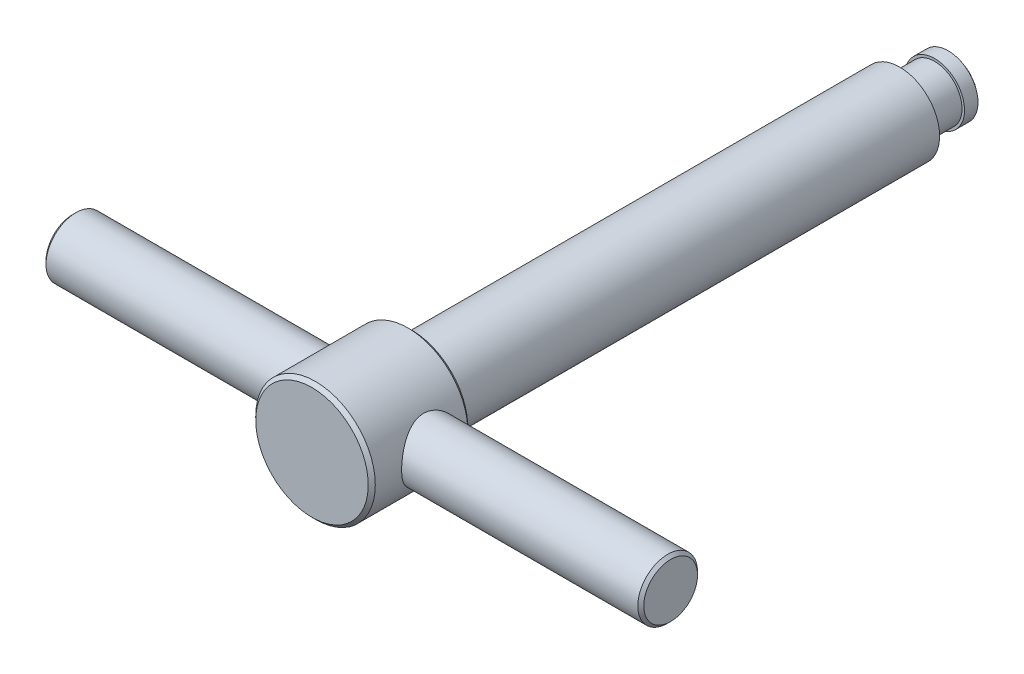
ISO-10303-21;
HEADER;
FILE_DESCRIPTION(('STEP AP214'),'2;1');
FILE_NAME('part.step','',(''),(''),'','','');
FILE_SCHEMA(('AUTOMOTIVE_DESIGN { 1 0 10303 214 1 1 1 1 }'));
ENDSEC;
DATA;
#1=APPLICATION_CONTEXT('core data for automotive mechanical design processes');
#2=APPLICATION_PROTOCOL_DEFINITION('international standard','automotive_design',2000,#1);
#3=PRODUCT_CONTEXT('',#1,'mechanical');
#4=PRODUCT('Part','Part','',(#3));
#5=PRODUCT_RELATED_PRODUCT_CATEGORY('part','',(#4));
#6=PRODUCT_DEFINITION_FORMATION('','',#4);
#7=PRODUCT_DEFINITION_CONTEXT('part definition',#1,'design');
#8=PRODUCT_DEFINITION('design','',#6,#7);
#9=PRODUCT_DEFINITION_SHAPE('','',#8);
#10=(LENGTH_UNIT() NAMED_UNIT(*) SI_UNIT(.MILLI.,.METRE.));
#11=(NAMED_UNIT(*) PLANE_ANGLE_UNIT() SI_UNIT($,.RADIAN.));
#12=(NAMED_UNIT(*) SI_UNIT($,.STERADIAN.) SOLID_ANGLE_UNIT());
#13=UNCERTAINTY_MEASURE_WITH_UNIT(LENGTH_MEASURE(1.E-05),#10,'distance_accuracy_value','');
#14=(GEOMETRIC_REPRESENTATION_CONTEXT(3) GLOBAL_UNCERTAINTY_ASSIGNED_CONTEXT((#13)) GLOBAL_UNIT_ASSIGNED_CONTEXT((#10,
#11,#12)) REPRESENTATION_CONTEXT('',''));
#15=CARTESIAN_POINT('',(0.,0.,0.));
#16=DIRECTION('',(0.,0.,1.));
#17=DIRECTION('',(1.,0.,0.));
#18=AXIS2_PLACEMENT_3D('',#15,#16,#17);
#19=CARTESIAN_POINT('',(60.,0.,123.4));
#20=DIRECTION('',(-1.,0.,0.));
#21=DIRECTION('',(0.,-1.,0.));
#22=AXIS2_PLACEMENT_3D('',#19,#20,#21);
#23=PLANE('',#22);
#24=CARTESIAN_POINT('',(60.0000000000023,0.,118.));
#25=DIRECTION('',(-1.,0.,0.));
#26=DIRECTION('',(0.,-1.,0.));
#27=AXIS2_PLACEMENT_3D('',#24,#25,#26);
#28=CIRCLE('',#27,5.39999999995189);
#29=CARTESIAN_POINT('',(60.0000000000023,-5.39999999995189,118.));
#30=VERTEX_POINT('',#29);
#31=EDGE_CURVE('E15',#30,#30,#28,.T.);
#32=ORIENTED_EDGE('',*,*,#31,.F.);
#33=EDGE_LOOP('',(#32));
#34=FACE_BOUND('',#33,.T.);
#35=ADVANCED_FACE('F12',(#34),#23,.F.);
#36=CARTESIAN_POINT('',(-60.,0.,118.));
#37=DIRECTION('',(1.,0.,0.));
#38=DIRECTION('',(0.,1.,0.));
#39=AXIS2_PLACEMENT_3D('',#36,#37,#38);
#40=PLANE('',#39);
#41=CARTESIAN_POINT('',(-60.0000000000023,0.,118.));
#42=DIRECTION('',(1.,0.,0.));
#43=DIRECTION('',(0.,0.,1.));
#44=AXIS2_PLACEMENT_3D('',#41,#42,#43);
#45=CIRCLE('',#44,5.40000000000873);
#46=CARTESIAN_POINT('',(-60.0000000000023,0.,123.400000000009));
#47=VERTEX_POINT('',#46);
#48=EDGE_CURVE('E133',#47,#47,#45,.T.);
#49=ORIENTED_EDGE('',*,*,#48,.F.);
#50=EDGE_LOOP('',(#49));
#51=FACE_BOUND('',#50,.T.);
#52=ADVANCED_FACE('F171',(#51),#40,.F.);
#53=CARTESIAN_POINT('',(0.,0.,9.));
#54=DIRECTION('',(-1.,0.,0.));
#55=DIRECTION('',(0.,1.,0.));
#56=AXIS2_PLACEMENT_3D('',#53,#54,#55);
#57=SPHERICAL_SURFACE('',#56,9.);
#58=CARTESIAN_POINT('',(0.,0.,2.29179606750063));
#59=DIRECTION('',(0.,0.,1.));
#60=DIRECTION('',(0.,-1.,0.));
#61=AXIS2_PLACEMENT_3D('',#58,#59,#60);
#62=CIRCLE('',#61,6.);
#63=CARTESIAN_POINT('',(0.,-6.,2.29179606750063));
#64=VERTEX_POINT('',#63);
#65=EDGE_CURVE('E126',#64,#64,#62,.T.);
#66=ORIENTED_EDGE('',*,*,#65,.F.);
#67=EDGE_LOOP('',(#66));
#68=FACE_BOUND('',#67,.T.);
#69=ADVANCED_FACE('F168',(#68),#57,.T.);
#70=CARTESIAN_POINT('',(59.400000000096,0.,118.));
#71=DIRECTION('',(-1.,0.,0.));
#72=DIRECTION('',(0.,-1.,0.));
#73=AXIS2_PLACEMENT_3D('',#70,#71,#72);
#74=CONICAL_SURFACE('',#73,5.99999999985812,0.785398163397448);
#75=CARTESIAN_POINT('',(59.4,0.,118.));
#76=DIRECTION('',(-1.,0.,0.));
#77=DIRECTION('',(0.,-1.,0.));
#78=AXIS2_PLACEMENT_3D('',#75,#76,#77);
#79=CIRCLE('',#78,6.);
#80=CARTESIAN_POINT('',(59.4,-6.,118.));
#81=VERTEX_POINT('',#80);
#82=EDGE_CURVE('E124',#81,#81,#79,.T.);
#83=ORIENTED_EDGE('',*,*,#82,.F.);
#84=EDGE_LOOP('',(#83));
#85=FACE_BOUND('',#84,.T.);
#86=ORIENTED_EDGE('',*,*,#31,.T.);
#87=EDGE_LOOP('',(#86));
#88=FACE_BOUND('',#87,.T.);
#89=ADVANCED_FACE('F164',(#85,#88),#74,.T.);
#90=CARTESIAN_POINT('',(0.,0.,130.));
#91=DIRECTION('',(0.,0.,-1.));
#92=DIRECTION('',(0.,1.,0.));
#93=AXIS2_PLACEMENT_3D('',#90,#91,#92);
#94=PLANE('',#93);
#95=CARTESIAN_POINT('',(0.,0.,130.));
#96=DIRECTION('',(0.,0.,-1.));
#97=DIRECTION('',(0.,1.,0.));
#98=AXIS2_PLACEMENT_3D('',#95,#96,#97);
#99=CIRCLE('',#98,11.2928932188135);
#100=CARTESIAN_POINT('',(0.,11.2928932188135,130.));
#101=VERTEX_POINT('',#100);
#102=EDGE_CURVE('E121',#101,#101,#99,.T.);
#103=ORIENTED_EDGE('',*,*,#102,.F.);
#104=EDGE_LOOP('',(#103));
#105=FACE_BOUND('',#104,.T.);
#106=ADVANCED_FACE('F160',(#105),#94,.F.);
#107=CARTESIAN_POINT('',(-59.3999999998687,0.,118.));
#108=DIRECTION('',(1.,0.,0.));
#109=DIRECTION('',(0.,0.,1.));
#110=AXIS2_PLACEMENT_3D('',#107,#108,#109);
#111=CONICAL_SURFACE('',#110,6.00000000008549,0.785398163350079);
#112=ORIENTED_EDGE('',*,*,#48,.T.);
#113=EDGE_LOOP('',(#112));
#114=FACE_BOUND('',#113,.T.);
#115=CARTESIAN_POINT('',(-59.4,0.,118.));
#116=DIRECTION('',(-1.,0.,0.));
#117=DIRECTION('',(0.,-1.,0.));
#118=AXIS2_PLACEMENT_3D('',#115,#116,#117);
#119=CIRCLE('',#118,6.);
#120=CARTESIAN_POINT('',(-59.4,-6.,118.));
#121=VERTEX_POINT('',#120);
#122=EDGE_CURVE('E117',#121,#121,#119,.F.);
#123=ORIENTED_EDGE('',*,*,#122,.F.);
#124=EDGE_LOOP('',(#123));
#125=FACE_BOUND('',#124,.T.);
#126=ADVANCED_FACE('F154',(#114,#125),#111,.T.);
#127=CARTESIAN_POINT('',(0.,0.,0.));
#128=DIRECTION('',(0.,0.,1.));
#129=DIRECTION('',(0.,-1.,0.));
#130=AXIS2_PLACEMENT_3D('',#127,#128,#129);
#131=CYLINDRICAL_SURFACE('',#130,6.);
#132=CARTESIAN_POINT('',(0.,0.,5.));
#133=DIRECTION('',(0.,0.,1.));
#134=DIRECTION('',(0.,-1.,0.));
#135=AXIS2_PLACEMENT_3D('',#132,#133,#134);
#136=CIRCLE('',#135,6.);
#137=CARTESIAN_POINT('',(0.,-6.,5.));
#138=VERTEX_POINT('',#137);
#139=EDGE_CURVE('E120',#138,#138,#136,.F.);
#140=ORIENTED_EDGE('',*,*,#139,.T.);
#141=EDGE_LOOP('',(#140));
#142=FACE_BOUND('',#141,.T.);
#143=ORIENTED_EDGE('',*,*,#65,.T.);
#144=EDGE_LOOP('',(#143));
#145=FACE_BOUND('',#144,.T.);
#146=ADVANCED_FACE('F147',(#142,#145),#131,.T.);
#147=CARTESIAN_POINT('',(60.,0.,118.));
#148=DIRECTION('',(-1.,0.,0.));
#149=DIRECTION('',(0.,-1.,0.));
#150=AXIS2_PLACEMENT_3D('',#147,#148,#149);
#151=CYLINDRICAL_SURFACE('',#150,6.);
#152=CARTESIAN_POINT('',(10.3967296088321,5.99232955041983,117.696707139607));
#153=CARTESIAN_POINT('',(10.4013641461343,5.98428985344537,117.537884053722));
#154=CARTESIAN_POINT('',(10.4096334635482,5.96993301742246,117.379463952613));
#155=CARTESIAN_POINT('',(10.4331256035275,5.92878096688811,117.064706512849));
#156=CARTESIAN_POINT('',(10.4483521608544,5.90197907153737,116.908370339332));
#157=CARTESIAN_POINT('',(10.4852220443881,5.83622654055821,116.598733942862));
#158=CARTESIAN_POINT('',(10.5068773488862,5.79725321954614,116.445439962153));
#159=CARTESIAN_POINT('',(10.5558238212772,5.70764223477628,116.143199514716));
#160=CARTESIAN_POINT('',(10.5831175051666,5.65699936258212,115.994255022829));
#161=CARTESIAN_POINT('',(10.6717668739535,5.4890258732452,115.557160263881));
#162=CARTESIAN_POINT('',(10.7401681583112,5.35518386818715,115.276593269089));
#163=CARTESIAN_POINT('',(10.8880451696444,5.04771900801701,114.741800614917));
#164=CARTESIAN_POINT('',(10.9675203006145,4.87409829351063,114.487573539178));
#165=CARTESIAN_POINT('',(11.1370713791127,4.4740222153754,113.988241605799));
#166=CARTESIAN_POINT('',(11.2274666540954,4.24427471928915,113.745877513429));
#167=CARTESIAN_POINT('',(11.4032291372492,3.74644538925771,113.301559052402));
#168=CARTESIAN_POINT('',(11.4885943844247,3.47834874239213,113.099620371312));
#169=CARTESIAN_POINT('',(11.6079649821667,3.04611998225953,112.827787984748));
#170=CARTESIAN_POINT('',(11.646974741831,2.89375494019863,112.740999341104));
#171=CARTESIAN_POINT('',(11.720220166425,2.58111511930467,112.580714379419));
#172=CARTESIAN_POINT('',(11.7544578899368,2.42084379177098,112.507212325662));
#173=CARTESIAN_POINT('',(11.8171423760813,2.09353999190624,112.374319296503));
#174=CARTESIAN_POINT('',(11.8455915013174,1.92651031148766,112.314922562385));
#175=CARTESIAN_POINT('',(11.8958437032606,1.58692880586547,112.210943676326));
#176=CARTESIAN_POINT('',(11.9176475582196,1.41437762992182,112.166359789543));
#177=CARTESIAN_POINT('',(11.9523359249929,1.08044086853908,112.095832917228));
#178=CARTESIAN_POINT('',(11.9658310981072,0.91938885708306,112.068606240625));
#179=CARTESIAN_POINT('',(11.9863301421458,0.595197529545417,112.027359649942));
#180=CARTESIAN_POINT('',(11.9933345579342,0.432058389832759,112.013338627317));
#181=CARTESIAN_POINT('',(12.0006537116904,0.105088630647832,111.998689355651));
#182=CARTESIAN_POINT('',(12.000970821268,-0.0587417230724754,111.998056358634));
#183=CARTESIAN_POINT('',(11.9949122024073,-0.385778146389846,112.010179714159));
#184=CARTESIAN_POINT('',(11.9885367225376,-0.548984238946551,112.022935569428));
#185=CARTESIAN_POINT('',(11.9699803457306,-0.861547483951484,112.06024680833));
#186=CARTESIAN_POINT('',(11.9582582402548,-1.01104436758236,112.083870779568));
#187=CARTESIAN_POINT('',(11.9294981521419,-1.30738064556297,112.142221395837));
#188=CARTESIAN_POINT('',(11.9124584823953,-1.4542191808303,112.176951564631));
#189=CARTESIAN_POINT('',(11.8734615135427,-1.74421949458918,112.257150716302));
#190=CARTESIAN_POINT('',(11.8515056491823,-1.88738233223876,112.302616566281));
#191=CARTESIAN_POINT('',(11.8031687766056,-2.16926380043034,112.403862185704));
#192=CARTESIAN_POINT('',(11.7767860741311,-2.30798070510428,112.459645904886));
#193=CARTESIAN_POINT('',(11.6898816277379,-2.72563439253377,112.645956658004));
#194=CARTESIAN_POINT('',(11.6229758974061,-2.99621625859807,112.79271375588));
#195=CARTESIAN_POINT('',(11.4783693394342,-3.50976933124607,113.124025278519));
#196=CARTESIAN_POINT('',(11.4006635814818,-3.75272783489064,113.308596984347));
#197=CARTESIAN_POINT('',(11.232947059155,-4.2297671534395,113.731454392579));
#198=CARTESIAN_POINT('',(11.1424800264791,-4.46058169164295,113.973250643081));
#199=CARTESIAN_POINT('',(10.9653912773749,-4.87976233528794,114.492960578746));
#200=CARTESIAN_POINT('',(10.8787720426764,-5.06810135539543,114.770897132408));
#201=CARTESIAN_POINT('',(10.7575950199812,-5.31819877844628,115.216570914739));
#202=CARTESIAN_POINT('',(10.7179644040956,-5.39739296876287,115.373371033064));
#203=CARTESIAN_POINT('',(10.643864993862,-5.5420880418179,115.694311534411));
#204=CARTESIAN_POINT('',(10.6093937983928,-5.60759529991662,115.85844845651));
#205=CARTESIAN_POINT('',(10.5469857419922,-5.72411263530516,116.192830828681));
#206=CARTESIAN_POINT('',(10.5190431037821,-5.77513553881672,116.363070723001));
#207=CARTESIAN_POINT('',(10.4708608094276,-5.86204340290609,116.70843712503));
#208=CARTESIAN_POINT('',(10.4506199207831,-5.89793078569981,116.883562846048));
#209=CARTESIAN_POINT('',(10.420411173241,-5.95112289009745,117.219002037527));
#210=CARTESIAN_POINT('',(10.4096046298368,-5.96995227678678,117.378999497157));
#211=CARTESIAN_POINT('',(10.3953867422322,-5.99467617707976,117.7003127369));
#212=CARTESIAN_POINT('',(10.391974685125,-6.00057193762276,117.861628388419));
#213=CARTESIAN_POINT('',(10.3926854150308,-5.99934075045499,118.184148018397));
#214=CARTESIAN_POINT('',(10.3968061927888,-5.99221727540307,118.345352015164));
#215=CARTESIAN_POINT('',(10.4124091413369,-5.96506323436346,118.666301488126));
#216=CARTESIAN_POINT('',(10.4238910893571,-5.94503305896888,118.826047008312));
#217=CARTESIAN_POINT('',(10.4524366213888,-5.89468609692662,119.128755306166));
#218=CARTESIAN_POINT('',(10.4689163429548,-5.86543648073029,119.271952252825));
#219=CARTESIAN_POINT('',(10.5070880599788,-5.79677768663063,119.555194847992));
#220=CARTESIAN_POINT('',(10.5287816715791,-5.75736535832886,119.695239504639));
#221=CARTESIAN_POINT('',(10.6007490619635,-5.62444241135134,120.109406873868));
#222=CARTESIAN_POINT('',(10.6579286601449,-5.51621366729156,120.377753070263));
#223=CARTESIAN_POINT('',(10.7895116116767,-5.25445945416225,120.9130963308));
#224=CARTESIAN_POINT('',(10.8648878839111,-5.09813619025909,121.178469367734));
#225=CARTESIAN_POINT('',(11.0223936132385,-4.74802594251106,121.681056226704));
#226=CARTESIAN_POINT('',(11.104527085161,-4.55421659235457,121.918253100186));
#227=CARTESIAN_POINT('',(11.2779849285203,-4.10741265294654,122.387013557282));
#228=CARTESIAN_POINT('',(11.3692423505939,-3.85012262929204,122.614562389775));
#229=CARTESIAN_POINT('',(11.4983181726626,-3.43652386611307,122.921370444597));
#230=CARTESIAN_POINT('',(11.5400655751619,-3.29394837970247,123.017937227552));
#231=CARTESIAN_POINT('',(11.6198691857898,-3.00028881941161,123.198842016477));
#232=CARTESIAN_POINT('',(11.6579271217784,-2.84920878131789,123.283185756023));
#233=CARTESIAN_POINT('',(11.7292455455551,-2.53968300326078,123.438747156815));
#234=CARTESIAN_POINT('',(11.7625139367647,-2.38124998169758,123.509986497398));
#235=CARTESIAN_POINT('',(11.823367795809,-2.05791468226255,123.638727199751));
#236=CARTESIAN_POINT('',(11.8509559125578,-1.89301546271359,123.696234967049));
#237=CARTESIAN_POINT('',(11.8996299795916,-1.55802349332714,123.796820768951));
#238=CARTESIAN_POINT('',(11.9207192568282,-1.38793345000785,123.839906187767));
#239=CARTESIAN_POINT('',(11.9557555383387,-1.0439282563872,123.911095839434));
#240=CARTESIAN_POINT('',(11.9697033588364,-0.870013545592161,123.939201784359));
#241=CARTESIAN_POINT('',(11.9890057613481,-0.537308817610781,123.97800203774));
#242=CARTESIAN_POINT('',(11.9950748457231,-0.378727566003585,123.990145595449));
#243=CARTESIAN_POINT('',(12.0008966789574,-0.0609889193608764,124.001795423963));
#244=CARTESIAN_POINT('',(12.0006498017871,0.0981684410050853,124.001302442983));
#245=CARTESIAN_POINT('',(11.9938467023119,0.415774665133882,123.987686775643));
#246=CARTESIAN_POINT('',(11.9872916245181,0.57422365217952,123.974566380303));
#247=CARTESIAN_POINT('',(11.9680493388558,0.889210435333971,123.935864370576));
#248=CARTESIAN_POINT('',(11.9553621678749,1.04574824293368,123.91028283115));
#249=CARTESIAN_POINT('',(11.9249214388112,1.34843417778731,123.848456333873));
#250=CARTESIAN_POINT('',(11.907435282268,1.49472395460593,123.812771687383));
#251=CARTESIAN_POINT('',(11.8676036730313,1.78361750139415,123.730731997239));
#252=CARTESIAN_POINT('',(11.8452566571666,1.92622006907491,123.684373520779));
#253=CARTESIAN_POINT('',(11.7716506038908,2.34715104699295,123.529923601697));
#254=CARTESIAN_POINT('',(11.7138014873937,2.6188403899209,123.406408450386));
#255=CARTESIAN_POINT('',(11.5814931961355,3.15433303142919,123.113610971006));
#256=CARTESIAN_POINT('',(11.5062385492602,3.41665496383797,122.942004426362));
#257=CARTESIAN_POINT('',(11.3480294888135,3.91017467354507,122.56155109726));
#258=CARTESIAN_POINT('',(11.2650706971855,4.14135456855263,122.352683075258));
#259=CARTESIAN_POINT('',(11.0904884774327,4.58959419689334,121.879657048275));
#260=CARTESIAN_POINT('',(10.9988086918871,4.80308099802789,121.612094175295));
#261=CARTESIAN_POINT('',(10.8685825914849,5.08771873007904,121.185044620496));
#262=CARTESIAN_POINT('',(10.8263558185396,5.17672801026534,121.038271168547));
#263=CARTESIAN_POINT('',(10.7456657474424,5.34220185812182,120.736857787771));
#264=CARTESIAN_POINT('',(10.707200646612,5.41867244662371,120.582221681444));
#265=CARTESIAN_POINT('',(10.6351987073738,5.5586673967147,120.265252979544));
#266=CARTESIAN_POINT('',(10.601683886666,5.62213437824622,120.102890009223));
#267=CARTESIAN_POINT('',(10.5410848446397,5.73494845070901,119.772244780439));
#268=CARTESIAN_POINT('',(10.5139971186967,5.78430323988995,119.603965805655));
#269=CARTESIAN_POINT('',(10.4674355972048,5.8681420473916,119.263178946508));
#270=CARTESIAN_POINT('',(10.4479420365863,5.90266469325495,119.090683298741));
#271=CARTESIAN_POINT('',(10.4173697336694,5.95645689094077,118.742683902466));
#272=CARTESIAN_POINT('',(10.4062850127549,5.97573728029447,118.567182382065));
#273=CARTESIAN_POINT('',(10.3953148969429,5.99478823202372,118.27554818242));
#274=CARTESIAN_POINT('',(10.3928876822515,5.99899031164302,118.15977751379));
#275=CARTESIAN_POINT('',(10.3919080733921,6.00068740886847,117.928169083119));
#276=CARTESIAN_POINT('',(10.393355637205,5.99818249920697,117.812331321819));
#277=CARTESIAN_POINT('',(10.3967296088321,5.99232955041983,117.696707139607));
#278=B_SPLINE_CURVE_WITH_KNOTS('',3,(#152,#153,#154,#155,#156,#157,#158,#159,#160,#161,#162,
#163,#164,#165,#166,#167,#168,#169,#170,#171,#172,#173,#174,#175,#176,#177,#178,#179,#180,#181,
#182,#183,#184,#185,#186,#187,#188,#189,#190,#191,#192,#193,#194,#195,#196,#197,#198,#199,#200,
#201,#202,#203,#204,#205,#206,#207,#208,#209,#210,#211,#212,#213,#214,#215,#216,#217,#218,#219,
#220,#221,#222,#223,#224,#225,#226,#227,#228,#229,#230,#231,#232,#233,#234,#235,#236,#237,#238,
#239,#240,#241,#242,#243,#244,#245,#246,#247,#248,#249,#250,#251,#252,#253,#254,#255,#256,#257,
#258,#259,#260,#261,#262,#263,#264,#265,#266,#267,#268,#269,#270,#271,#272,#273,#274,#275,#276,
#277),.UNSPECIFIED.,.T.,.F.,(4,2,2,2,2,2,2,2,2,2,2,2,2,2,2,2,2,2,2,2,2,2,2,2,2,2,2,2,2,2,2,2,2,
2,2,2,2,2,2,2,2,2,2,2,2,2,2,2,2,2,2,2,2,2,2,2,2,2,2,2,2,2,4),(0.,0.477157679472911,
0.954571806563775,1.43288111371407,1.91140431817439,2.86186573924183,3.81227602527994,
4.84577885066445,5.87968196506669,6.41798239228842,6.95604988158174,7.49389731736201,
8.03168173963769,8.52270914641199,9.01369533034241,9.50450738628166,9.99530121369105,
10.4501927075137,10.9052286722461,11.360132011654,11.8152098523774,12.7559779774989,
13.6971769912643,14.7316562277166,15.7667932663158,16.3064145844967,16.8457839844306,
17.3846742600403,17.9234782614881,18.4071994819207,18.8908740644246,19.3744196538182,
19.8579506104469,20.2986917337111,20.7395696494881,21.6207508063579,22.5683036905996,
23.5164236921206,24.5771474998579,25.1081792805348,25.6389611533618,26.1688568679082,
26.6985049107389,27.2278813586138,27.7571972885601,28.2340678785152,28.7109102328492,
29.187666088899,29.6644190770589,30.1186690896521,30.5730653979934,31.4811344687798,
32.4443599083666,33.4081361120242,34.4658570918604,34.9956433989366,35.5251745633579,
36.056994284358,36.5885233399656,37.1186596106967,37.6484186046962,37.9957960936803,
38.3431698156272),.UNSPECIFIED.);
#279=CARTESIAN_POINT('',(10.3967296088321,5.99232955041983,117.696707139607));
#280=VERTEX_POINT('',#279);
#281=EDGE_CURVE('E46',#280,#280,#278,.T.);
#282=ORIENTED_EDGE('',*,*,#281,.F.);
#283=EDGE_LOOP('',(#282));
#284=FACE_BOUND('',#283,.T.);
#285=ORIENTED_EDGE('',*,*,#82,.T.);
#286=EDGE_LOOP('',(#285));
#287=FACE_BOUND('',#286,.T.);
#288=ADVANCED_FACE('F145',(#284,#287),#151,.T.);
#289=CARTESIAN_POINT('',(0.,0.,129.292893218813));
#290=DIRECTION('',(0.,0.,-1.));
#291=DIRECTION('',(0.,1.,0.));
#292=AXIS2_PLACEMENT_3D('',#289,#290,#291);
#293=CONICAL_SURFACE('',#292,12.0000000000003,0.785398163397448);
#294=ORIENTED_EDGE('',*,*,#102,.T.);
#295=EDGE_LOOP('',(#294));
#296=FACE_BOUND('',#295,.T.);
#297=CARTESIAN_POINT('',(0.,0.,129.292893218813));
#298=DIRECTION('',(0.,0.,1.));
#299=DIRECTION('',(0.,-1.,0.));
#300=AXIS2_PLACEMENT_3D('',#297,#298,#299);
#301=CIRCLE('',#300,12.);
#302=CARTESIAN_POINT('',(0.,-12.,129.292893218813));
#303=VERTEX_POINT('',#302);
#304=EDGE_CURVE('E45',#303,#303,#301,.F.);
#305=ORIENTED_EDGE('',*,*,#304,.F.);
#306=EDGE_LOOP('',(#305));
#307=FACE_BOUND('',#306,.T.);
#308=ADVANCED_FACE('F72',(#296,#307),#293,.T.);
#309=CARTESIAN_POINT('',(60.,0.,118.));
#310=DIRECTION('',(-1.,0.,0.));
#311=DIRECTION('',(0.,-1.,0.));
#312=AXIS2_PLACEMENT_3D('',#309,#310,#311);
#313=CYLINDRICAL_SURFACE('',#312,6.);
#314=ORIENTED_EDGE('',*,*,#122,.T.);
#315=EDGE_LOOP('',(#314));
#316=FACE_BOUND('',#315,.T.);
#317=CARTESIAN_POINT('',(-10.3967296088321,5.99232955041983,118.303292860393));
#318=CARTESIAN_POINT('',(-10.4013641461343,5.98428985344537,118.462115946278));
#319=CARTESIAN_POINT('',(-10.4096334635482,5.96993301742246,118.620536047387));
#320=CARTESIAN_POINT('',(-10.4331256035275,5.92878096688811,118.935293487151));
#321=CARTESIAN_POINT('',(-10.4483521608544,5.90197907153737,119.091629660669));
#322=CARTESIAN_POINT('',(-10.4852220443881,5.8362265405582,119.401266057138));
#323=CARTESIAN_POINT('',(-10.5068773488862,5.79725321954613,119.554560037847));
#324=CARTESIAN_POINT('',(-10.5558238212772,5.70764223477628,119.856800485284));
#325=CARTESIAN_POINT('',(-10.5831175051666,5.65699936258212,120.005744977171));
#326=CARTESIAN_POINT('',(-10.6717668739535,5.48902587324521,120.442839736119));
#327=CARTESIAN_POINT('',(-10.7401681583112,5.35518386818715,120.723406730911));
#328=CARTESIAN_POINT('',(-10.8880451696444,5.04771900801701,121.258199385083));
#329=CARTESIAN_POINT('',(-10.9675203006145,4.87409829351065,121.512426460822));
#330=CARTESIAN_POINT('',(-11.1370713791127,4.47402221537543,122.011758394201));
#331=CARTESIAN_POINT('',(-11.2274666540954,4.24427471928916,122.254122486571));
#332=CARTESIAN_POINT('',(-11.4032291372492,3.74644538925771,122.698440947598));
#333=CARTESIAN_POINT('',(-11.4885943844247,3.47834874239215,122.900379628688));
#334=CARTESIAN_POINT('',(-11.6079649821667,3.04611998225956,123.172212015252));
#335=CARTESIAN_POINT('',(-11.646974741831,2.89375494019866,123.259000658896));
#336=CARTESIAN_POINT('',(-11.720220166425,2.58111511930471,123.419285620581));
#337=CARTESIAN_POINT('',(-11.7544578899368,2.42084379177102,123.492787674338));
#338=CARTESIAN_POINT('',(-11.8171423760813,2.0935399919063,123.625680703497));
#339=CARTESIAN_POINT('',(-11.8455915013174,1.92651031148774,123.685077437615));
#340=CARTESIAN_POINT('',(-11.8958437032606,1.58692880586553,123.789056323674));
#341=CARTESIAN_POINT('',(-11.9176475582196,1.41437762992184,123.833640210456));
#342=CARTESIAN_POINT('',(-11.9523359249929,1.08044086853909,123.904167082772));
#343=CARTESIAN_POINT('',(-11.9658310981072,0.919388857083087,123.931393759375));
#344=CARTESIAN_POINT('',(-11.9863301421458,0.595197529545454,123.972640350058));
#345=CARTESIAN_POINT('',(-11.9933345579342,0.432058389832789,123.986661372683));
#346=CARTESIAN_POINT('',(-12.0006537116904,0.10508863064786,124.001310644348));
#347=CARTESIAN_POINT('',(-12.000970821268,-0.0587417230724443,124.001943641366));
#348=CARTESIAN_POINT('',(-11.9949122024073,-0.385778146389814,123.989820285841));
#349=CARTESIAN_POINT('',(-11.9885367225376,-0.54898423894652,123.977064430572));
#350=CARTESIAN_POINT('',(-11.9699803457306,-0.861547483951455,123.93975319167));
#351=CARTESIAN_POINT('',(-11.9582582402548,-1.01104436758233,123.916129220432));
#352=CARTESIAN_POINT('',(-11.9294981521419,-1.30738064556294,123.857778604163));
#353=CARTESIAN_POINT('',(-11.9124584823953,-1.45421918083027,123.823048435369));
#354=CARTESIAN_POINT('',(-11.8734615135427,-1.74421949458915,123.742849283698));
#355=CARTESIAN_POINT('',(-11.8515056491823,-1.88738233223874,123.697383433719));
#356=CARTESIAN_POINT('',(-11.8031687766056,-2.16926380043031,123.596137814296));
#357=CARTESIAN_POINT('',(-11.7767860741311,-2.30798070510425,123.540354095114));
#358=CARTESIAN_POINT('',(-11.6898816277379,-2.72563439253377,123.354043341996));
#359=CARTESIAN_POINT('',(-11.6229758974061,-2.99621625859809,123.20728624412));
#360=CARTESIAN_POINT('',(-11.4783693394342,-3.50976933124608,122.875974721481));
#361=CARTESIAN_POINT('',(-11.4006635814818,-3.75272783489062,122.691403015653));
#362=CARTESIAN_POINT('',(-11.232947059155,-4.22976715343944,122.268545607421));
#363=CARTESIAN_POINT('',(-11.1424800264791,-4.46058169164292,122.026749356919));
#364=CARTESIAN_POINT('',(-10.9653912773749,-4.87976233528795,121.507039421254));
#365=CARTESIAN_POINT('',(-10.8787720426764,-5.06810135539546,121.229102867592));
#366=CARTESIAN_POINT('',(-10.7575950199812,-5.31819877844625,120.783429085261));
#367=CARTESIAN_POINT('',(-10.7179644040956,-5.39739296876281,120.626628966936));
#368=CARTESIAN_POINT('',(-10.643864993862,-5.54208804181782,120.305688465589));
#369=CARTESIAN_POINT('',(-10.6093937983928,-5.60759529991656,120.14155154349));
#370=CARTESIAN_POINT('',(-10.5469857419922,-5.72411263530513,119.807169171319));
#371=CARTESIAN_POINT('',(-10.5190431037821,-5.7751355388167,119.636929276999));
#372=CARTESIAN_POINT('',(-10.4708608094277,-5.86204340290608,119.29156287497));
#373=CARTESIAN_POINT('',(-10.4506199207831,-5.8979307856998,119.116437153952));
#374=CARTESIAN_POINT('',(-10.420411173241,-5.95112289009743,118.780997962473));
#375=CARTESIAN_POINT('',(-10.4096046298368,-5.96995227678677,118.621000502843));
#376=CARTESIAN_POINT('',(-10.3953867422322,-5.99467617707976,118.2996872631));
#377=CARTESIAN_POINT('',(-10.391974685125,-6.00057193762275,118.138371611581));
#378=CARTESIAN_POINT('',(-10.3926854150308,-5.99934075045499,117.815851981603));
#379=CARTESIAN_POINT('',(-10.3968061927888,-5.99221727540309,117.654647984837));
#380=CARTESIAN_POINT('',(-10.4124091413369,-5.96506323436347,117.333698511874));
#381=CARTESIAN_POINT('',(-10.4238910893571,-5.94503305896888,117.173952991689));
#382=CARTESIAN_POINT('',(-10.4524366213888,-5.89468609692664,116.871244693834));
#383=CARTESIAN_POINT('',(-10.4689163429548,-5.86543648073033,116.728047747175));
#384=CARTESIAN_POINT('',(-10.5070880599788,-5.79677768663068,116.444805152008));
#385=CARTESIAN_POINT('',(-10.5287816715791,-5.75736535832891,116.304760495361));
#386=CARTESIAN_POINT('',(-10.6007490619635,-5.62444241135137,115.890593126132));
#387=CARTESIAN_POINT('',(-10.6579286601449,-5.51621366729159,115.622246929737));
#388=CARTESIAN_POINT('',(-10.7895116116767,-5.25445945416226,115.0869036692));
#389=CARTESIAN_POINT('',(-10.8648878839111,-5.09813619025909,114.821530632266));
#390=CARTESIAN_POINT('',(-11.0223936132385,-4.74802594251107,114.318943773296));
#391=CARTESIAN_POINT('',(-11.104527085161,-4.55421659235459,114.081746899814));
#392=CARTESIAN_POINT('',(-11.2779849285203,-4.10741265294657,113.612986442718));
#393=CARTESIAN_POINT('',(-11.3692423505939,-3.85012262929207,113.385437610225));
#394=CARTESIAN_POINT('',(-11.4983181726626,-3.4365238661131,113.078629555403));
#395=CARTESIAN_POINT('',(-11.5400655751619,-3.29394837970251,112.982062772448));
#396=CARTESIAN_POINT('',(-11.6198691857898,-3.00028881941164,112.801157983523));
#397=CARTESIAN_POINT('',(-11.6579271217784,-2.84920878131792,112.716814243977));
#398=CARTESIAN_POINT('',(-11.7292455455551,-2.53968300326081,112.561252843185));
#399=CARTESIAN_POINT('',(-11.7625139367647,-2.38124998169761,112.490013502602));
#400=CARTESIAN_POINT('',(-11.823367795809,-2.05791468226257,112.361272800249));
#401=CARTESIAN_POINT('',(-11.8509559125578,-1.8930154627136,112.303765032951));
#402=CARTESIAN_POINT('',(-11.8996299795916,-1.55802349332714,112.203179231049));
#403=CARTESIAN_POINT('',(-11.9207192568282,-1.38793345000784,112.160093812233));
#404=CARTESIAN_POINT('',(-11.9557555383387,-1.0439282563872,112.088904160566));
#405=CARTESIAN_POINT('',(-11.9697033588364,-0.870013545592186,112.060798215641));
#406=CARTESIAN_POINT('',(-11.9890057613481,-0.537308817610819,112.02199796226));
#407=CARTESIAN_POINT('',(-11.9950748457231,-0.378727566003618,112.009854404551));
#408=CARTESIAN_POINT('',(-12.0008966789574,-0.0609889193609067,111.998204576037));
#409=CARTESIAN_POINT('',(-12.0006498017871,0.0981684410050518,111.998697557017));
#410=CARTESIAN_POINT('',(-11.9938467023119,0.415774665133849,112.012313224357));
#411=CARTESIAN_POINT('',(-11.9872916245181,0.574223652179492,112.025433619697));
#412=CARTESIAN_POINT('',(-11.9680493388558,0.889210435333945,112.064135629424));
#413=CARTESIAN_POINT('',(-11.9553621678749,1.04574824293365,112.08971716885));
#414=CARTESIAN_POINT('',(-11.9249214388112,1.34843417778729,112.151543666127));
#415=CARTESIAN_POINT('',(-11.907435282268,1.49472395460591,112.187228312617));
#416=CARTESIAN_POINT('',(-11.8676036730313,1.78361750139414,112.269268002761));
#417=CARTESIAN_POINT('',(-11.8452566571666,1.92622006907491,112.315626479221));
#418=CARTESIAN_POINT('',(-11.7716506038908,2.34715104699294,112.470076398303));
#419=CARTESIAN_POINT('',(-11.7138014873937,2.61884038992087,112.593591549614));
#420=CARTESIAN_POINT('',(-11.5814931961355,3.15433303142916,112.886389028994));
#421=CARTESIAN_POINT('',(-11.5062385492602,3.41665496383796,113.057995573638));
#422=CARTESIAN_POINT('',(-11.3480294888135,3.91017467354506,113.43844890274));
#423=CARTESIAN_POINT('',(-11.2650706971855,4.14135456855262,113.647316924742));
#424=CARTESIAN_POINT('',(-11.0904884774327,4.58959419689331,114.120342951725));
#425=CARTESIAN_POINT('',(-10.9988086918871,4.80308099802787,114.387905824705));
#426=CARTESIAN_POINT('',(-10.8685825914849,5.08771873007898,114.814955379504));
#427=CARTESIAN_POINT('',(-10.8263558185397,5.17672801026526,114.961728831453));
#428=CARTESIAN_POINT('',(-10.7456657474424,5.34220185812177,115.263142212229));
#429=CARTESIAN_POINT('',(-10.707200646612,5.4186724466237,115.417778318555));
#430=CARTESIAN_POINT('',(-10.6351987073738,5.5586673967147,115.734747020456));
#431=CARTESIAN_POINT('',(-10.601683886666,5.62213437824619,115.897109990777));
#432=CARTESIAN_POINT('',(-10.5410848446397,5.73494845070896,116.227755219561));
#433=CARTESIAN_POINT('',(-10.5139971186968,5.78430323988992,116.396034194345));
#434=CARTESIAN_POINT('',(-10.4674355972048,5.86814204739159,116.736821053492));
#435=CARTESIAN_POINT('',(-10.4479420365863,5.90266469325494,116.909316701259));
#436=CARTESIAN_POINT('',(-10.4173697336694,5.95645689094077,117.257316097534));
#437=CARTESIAN_POINT('',(-10.4062850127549,5.97573728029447,117.432817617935));
#438=CARTESIAN_POINT('',(-10.3953148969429,5.99478823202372,117.72445181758));
#439=CARTESIAN_POINT('',(-10.3928876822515,5.99899031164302,117.84022248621));
#440=CARTESIAN_POINT('',(-10.3919080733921,6.00068740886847,118.071830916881));
#441=CARTESIAN_POINT('',(-10.393355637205,5.99818249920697,118.187668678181));
#442=CARTESIAN_POINT('',(-10.3967296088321,5.99232955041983,118.303292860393));
#443=B_SPLINE_CURVE_WITH_KNOTS('',3,(#317,#318,#319,#320,#321,#322,#323,#324,#325,#326,#327,
#328,#329,#330,#331,#332,#333,#334,#335,#336,#337,#338,#339,#340,#341,#342,#343,#344,#345,#346,
#347,#348,#349,#350,#351,#352,#353,#354,#355,#356,#357,#358,#359,#360,#361,#362,#363,#364,#365,
#366,#367,#368,#369,#370,#371,#372,#373,#374,#375,#376,#377,#378,#379,#380,#381,#382,#383,#384,
#385,#386,#387,#388,#389,#390,#391,#392,#393,#394,#395,#396,#397,#398,#399,#400,#401,#402,#403,
#404,#405,#406,#407,#408,#409,#410,#411,#412,#413,#414,#415,#416,#417,#418,#419,#420,#421,#422,
#423,#424,#425,#426,#427,#428,#429,#430,#431,#432,#433,#434,#435,#436,#437,#438,#439,#440,#441,
#442),.UNSPECIFIED.,.T.,.F.,(4,2,2,2,2,2,2,2,2,2,2,2,2,2,2,2,2,2,2,2,2,2,2,2,2,2,2,2,2,2,2,2,2,
2,2,2,2,2,2,2,2,2,2,2,2,2,2,2,2,2,2,2,2,2,2,2,2,2,2,2,2,2,4),(0.,0.477157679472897,
0.954571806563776,1.43288111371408,1.91140431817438,2.86186573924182,3.81227602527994,
4.84577885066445,5.87968196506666,6.41798239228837,6.95604988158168,7.49389731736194,
8.03168173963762,8.52270914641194,9.01369533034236,9.50450738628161,9.995301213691,
10.4501927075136,10.905228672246,11.3601320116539,11.8152098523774,12.7559779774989,
13.6971769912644,14.7316562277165,15.7667932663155,16.3064145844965,16.8457839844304,
17.3846742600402,17.9234782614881,18.4071994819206,18.8908740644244,19.374419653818,
19.8579506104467,20.2986917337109,20.7395696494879,21.6207508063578,22.5683036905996,
23.5164236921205,24.5771474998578,25.1081792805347,25.6389611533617,26.1688568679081,
26.6985049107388,27.2278813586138,27.7571972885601,28.2340678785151,28.7109102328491,
29.187666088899,29.6644190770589,30.1186690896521,30.5730653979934,31.4811344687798,
32.4443599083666,33.4081361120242,34.4658570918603,34.9956433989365,35.5251745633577,
36.0569942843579,36.5885233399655,37.1186596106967,37.6484186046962,37.9957960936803,
38.3431698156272),.UNSPECIFIED.);
#444=CARTESIAN_POINT('',(-10.3967296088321,5.99232955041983,118.303292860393));
#445=VERTEX_POINT('',#444);
#446=EDGE_CURVE('E37',#445,#445,#443,.T.);
#447=ORIENTED_EDGE('',*,*,#446,.F.);
#448=EDGE_LOOP('',(#447));
#449=FACE_BOUND('',#448,.T.);
#450=ADVANCED_FACE('F52',(#316,#449),#313,.T.);
#451=CARTESIAN_POINT('',(5.5,0.,5.));
#452=DIRECTION('',(0.,0.,-1.));
#453=DIRECTION('',(0.,1.,0.));
#454=AXIS2_PLACEMENT_3D('',#451,#452,#453);
#455=PLANE('',#454);
#456=CARTESIAN_POINT('',(0.,0.,5.));
#457=DIRECTION('',(0.,0.,1.));
#458=DIRECTION('',(0.,-1.,0.));
#459=AXIS2_PLACEMENT_3D('',#456,#457,#458);
#460=CIRCLE('',#459,5.5);
#461=CARTESIAN_POINT('',(0.,-5.5,5.));
#462=VERTEX_POINT('',#461);
#463=EDGE_CURVE('E33',#462,#462,#460,.T.);
#464=ORIENTED_EDGE('',*,*,#463,.F.);
#465=EDGE_LOOP('',(#464));
#466=FACE_BOUND('',#465,.T.);
#467=ORIENTED_EDGE('',*,*,#139,.F.);
#468=EDGE_LOOP('',(#467));
#469=FACE_BOUND('',#468,.T.);
#470=ADVANCED_FACE('F61',(#466,#469),#455,.F.);
#471=CARTESIAN_POINT('',(0.,0.,0.));
#472=DIRECTION('',(0.,0.,1.));
#473=DIRECTION('',(0.,-1.,0.));
#474=AXIS2_PLACEMENT_3D('',#471,#472,#473);
#475=CYLINDRICAL_SURFACE('',#474,12.);
#476=ORIENTED_EDGE('',*,*,#446,.T.);
#477=EDGE_LOOP('',(#476));
#478=FACE_BOUND('',#477,.T.);
#479=ORIENTED_EDGE('',*,*,#304,.T.);
#480=EDGE_LOOP('',(#479));
#481=FACE_BOUND('',#480,.T.);
#482=ORIENTED_EDGE('',*,*,#281,.T.);
#483=EDGE_LOOP('',(#482));
#484=FACE_BOUND('',#483,.T.);
#485=CARTESIAN_POINT('',(0.,0.,110.707106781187));
#486=DIRECTION('',(0.,0.,1.));
#487=DIRECTION('',(0.,-1.,0.));
#488=AXIS2_PLACEMENT_3D('',#485,#486,#487);
#489=CIRCLE('',#488,12.);
#490=CARTESIAN_POINT('',(0.,-12.,110.707106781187));
#491=VERTEX_POINT('',#490);
#492=EDGE_CURVE('E36',#491,#491,#489,.F.);
#493=ORIENTED_EDGE('',*,*,#492,.F.);
#494=EDGE_LOOP('',(#493));
#495=FACE_BOUND('',#494,.T.);
#496=ADVANCED_FACE('F56',(#478,#481,#484,#495),#475,.T.);
#497=CARTESIAN_POINT('',(0.,0.,0.));
#498=DIRECTION('',(0.,0.,1.));
#499=DIRECTION('',(0.,-1.,0.));
#500=AXIS2_PLACEMENT_3D('',#497,#498,#499);
#501=CYLINDRICAL_SURFACE('',#500,5.5);
#502=CARTESIAN_POINT('',(0.,0.,10.5566243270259));
#503=DIRECTION('',(0.,0.,1.));
#504=DIRECTION('',(0.,-1.,0.));
#505=AXIS2_PLACEMENT_3D('',#502,#503,#504);
#506=CIRCLE('',#505,5.5);
#507=CARTESIAN_POINT('',(0.,-5.5,10.5566243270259));
#508=VERTEX_POINT('',#507);
#509=EDGE_CURVE('E32',#508,#508,#506,.T.);
#510=ORIENTED_EDGE('',*,*,#509,.F.);
#511=EDGE_LOOP('',(#510));
#512=FACE_BOUND('',#511,.T.);
#513=ORIENTED_EDGE('',*,*,#463,.T.);
#514=EDGE_LOOP('',(#513));
#515=FACE_BOUND('',#514,.T.);
#516=ADVANCED_FACE('F60',(#512,#515),#501,.T.);
#517=CARTESIAN_POINT('',(0.,0.,110.707106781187));
#518=DIRECTION('',(0.,0.,1.));
#519=DIRECTION('',(-1.,0.,0.));
#520=AXIS2_PLACEMENT_3D('',#517,#518,#519);
#521=CONICAL_SURFACE('',#520,12.,0.78539816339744);
#522=ORIENTED_EDGE('',*,*,#492,.T.);
#523=EDGE_LOOP('',(#522));
#524=FACE_BOUND('',#523,.T.);
#525=CARTESIAN_POINT('',(0.,0.,110.));
#526=DIRECTION('',(0.,0.,1.));
#527=DIRECTION('',(-1.,0.,0.));
#528=AXIS2_PLACEMENT_3D('',#525,#526,#527);
#529=CIRCLE('',#528,11.2928932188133);
#530=CARTESIAN_POINT('',(-11.2928932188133,0.,110.));
#531=VERTEX_POINT('',#530);
#532=EDGE_CURVE('E24',#531,#531,#529,.T.);
#533=ORIENTED_EDGE('',*,*,#532,.T.);
#534=EDGE_LOOP('',(#533));
#535=FACE_BOUND('',#534,.T.);
#536=ADVANCED_FACE('F90',(#524,#535),#521,.T.);
#537=CARTESIAN_POINT('',(0.,0.,12.));
#538=DIRECTION('',(0.,0.,1.));
#539=DIRECTION('',(0.,-1.,0.));
#540=AXIS2_PLACEMENT_3D('',#537,#538,#539);
#541=CONICAL_SURFACE('',#540,8.,1.0471975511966);
#542=CARTESIAN_POINT('',(0.,0.,12.));
#543=DIRECTION('',(0.,0.,1.));
#544=DIRECTION('',(0.,-1.,0.));
#545=AXIS2_PLACEMENT_3D('',#542,#543,#544);
#546=CIRCLE('',#545,8.);
#547=CARTESIAN_POINT('',(0.,-8.,12.));
#548=VERTEX_POINT('',#547);
#549=EDGE_CURVE('E19',#548,#548,#546,.T.);
#550=ORIENTED_EDGE('',*,*,#549,.F.);
#551=EDGE_LOOP('',(#550));
#552=FACE_BOUND('',#551,.T.);
#553=ORIENTED_EDGE('',*,*,#509,.T.);
#554=EDGE_LOOP('',(#553));
#555=FACE_BOUND('',#554,.T.);
#556=ADVANCED_FACE('F84',(#552,#555),#541,.T.);
#557=CARTESIAN_POINT('',(11.2928932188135,0.,110.));
#558=DIRECTION('',(0.,0.,1.));
#559=DIRECTION('',(0.,-1.,0.));
#560=AXIS2_PLACEMENT_3D('',#557,#558,#559);
#561=PLANE('',#560);
#562=ORIENTED_EDGE('',*,*,#532,.F.);
#563=EDGE_LOOP('',(#562));
#564=FACE_BOUND('',#563,.T.);
#565=CARTESIAN_POINT('',(0.,0.,110.));
#566=DIRECTION('',(0.,0.,1.));
#567=DIRECTION('',(0.,-1.,0.));
#568=AXIS2_PLACEMENT_3D('',#565,#566,#567);
#569=CIRCLE('',#568,8.);
#570=CARTESIAN_POINT('',(0.,-8.,110.));
#571=VERTEX_POINT('',#570);
#572=EDGE_CURVE('E8',#571,#571,#569,.F.);
#573=ORIENTED_EDGE('',*,*,#572,.F.);
#574=EDGE_LOOP('',(#573));
#575=FACE_BOUND('',#574,.T.);
#576=ADVANCED_FACE('F78',(#564,#575),#561,.F.);
#577=CARTESIAN_POINT('',(0.,0.,0.));
#578=DIRECTION('',(0.,0.,1.));
#579=DIRECTION('',(0.,-1.,0.));
#580=AXIS2_PLACEMENT_3D('',#577,#578,#579);
#581=CYLINDRICAL_SURFACE('',#580,8.);
#582=ORIENTED_EDGE('',*,*,#572,.T.);
#583=EDGE_LOOP('',(#582));
#584=FACE_BOUND('',#583,.T.);
#585=ORIENTED_EDGE('',*,*,#549,.T.);
#586=EDGE_LOOP('',(#585));
#587=FACE_BOUND('',#586,.T.);
#588=ADVANCED_FACE('F76',(#584,#587),#581,.T.);
#589=CLOSED_SHELL('',(#35,#52,#69,#89,#106,#126,#146,#288,#308,#450,#470,#496,#516,#536,#556,
#576,#588));
#590=MANIFOLD_SOLID_BREP('B1',#589);
#591=ADVANCED_BREP_SHAPE_REPRESENTATION('',(#18,#590),#14);
#592=SHAPE_DEFINITION_REPRESENTATION(#9,#591);
ENDSEC;
END-ISO-10303-21;
